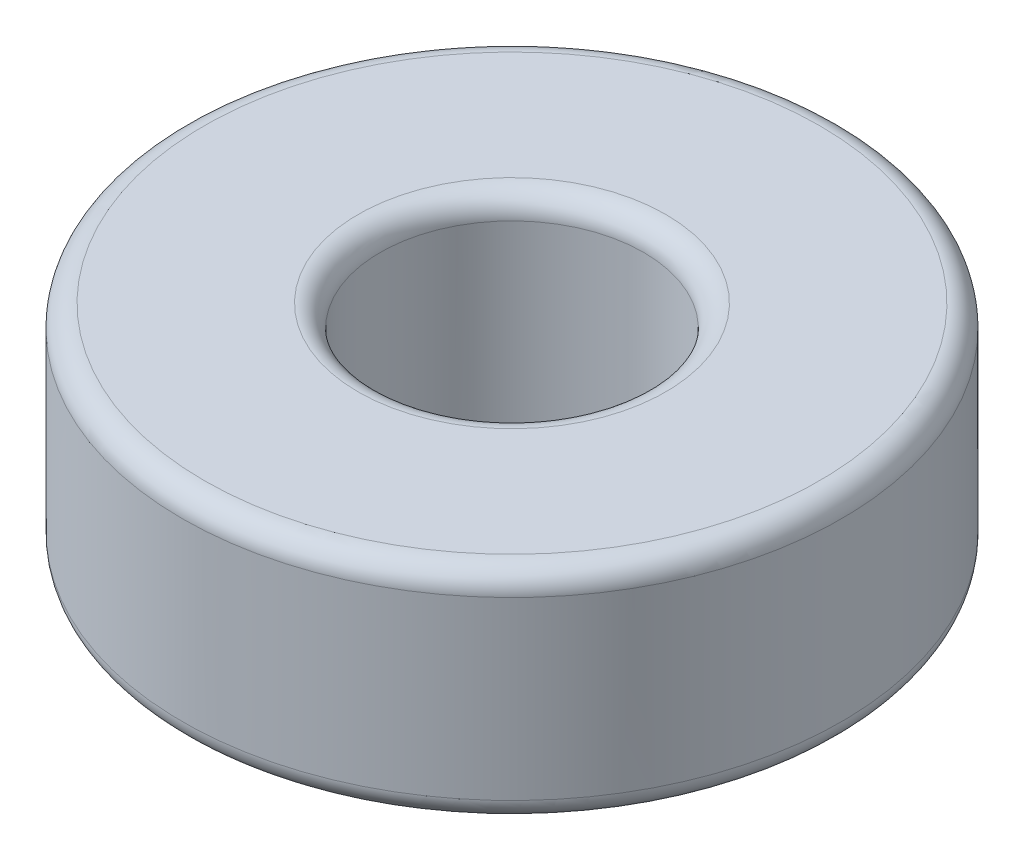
ISO-10303-21;
HEADER;
FILE_DESCRIPTION(('STEP AP214'),'2;1');
FILE_NAME('part.step','',(''),(''),'','','');
FILE_SCHEMA(('AUTOMOTIVE_DESIGN { 1 0 10303 214 1 1 1 1 }'));
ENDSEC;
DATA;
#1=APPLICATION_CONTEXT('core data for automotive mechanical design processes');
#2=APPLICATION_PROTOCOL_DEFINITION('international standard','automotive_design',2000,#1);
#3=PRODUCT_CONTEXT('',#1,'mechanical');
#4=PRODUCT('Part','Part','',(#3));
#5=PRODUCT_RELATED_PRODUCT_CATEGORY('part','',(#4));
#6=PRODUCT_DEFINITION_FORMATION('','',#4);
#7=PRODUCT_DEFINITION_CONTEXT('part definition',#1,'design');
#8=PRODUCT_DEFINITION('design','',#6,#7);
#9=PRODUCT_DEFINITION_SHAPE('','',#8);
#10=(LENGTH_UNIT() NAMED_UNIT(*) SI_UNIT(.MILLI.,.METRE.));
#11=(NAMED_UNIT(*) PLANE_ANGLE_UNIT() SI_UNIT($,.RADIAN.));
#12=(NAMED_UNIT(*) SI_UNIT($,.STERADIAN.) SOLID_ANGLE_UNIT());
#13=UNCERTAINTY_MEASURE_WITH_UNIT(LENGTH_MEASURE(1.E-05),#10,'distance_accuracy_value','');
#14=(GEOMETRIC_REPRESENTATION_CONTEXT(3) GLOBAL_UNCERTAINTY_ASSIGNED_CONTEXT((#13)) GLOBAL_UNIT_ASSIGNED_CONTEXT((#10,
#11,#12)) REPRESENTATION_CONTEXT('',''));
#15=CARTESIAN_POINT('',(0.,0.,0.));
#16=DIRECTION('',(0.,0.,1.));
#17=DIRECTION('',(1.,0.,0.));
#18=AXIS2_PLACEMENT_3D('',#15,#16,#17);
#19=CARTESIAN_POINT('',(0.,0.,0.));
#20=DIRECTION('',(0.,1.,0.));
#21=DIRECTION('',(0.,0.,1.));
#22=AXIS2_PLACEMENT_3D('',#19,#20,#21);
#23=PLANE('',#22);
#24=CARTESIAN_POINT('',(0.,0.,0.));
#25=DIRECTION('',(0.,1.,0.));
#26=DIRECTION('',(0.,0.,1.));
#27=AXIS2_PLACEMENT_3D('',#24,#25,#26);
#28=CIRCLE('',#27,7.);
#29=CARTESIAN_POINT('',(0.,0.,7.));
#30=VERTEX_POINT('',#29);
#31=CARTESIAN_POINT('',(0.,0.,-7.));
#32=VERTEX_POINT('',#31);
#33=EDGE_CURVE('E65',#30,#32,#28,.T.);
#34=ORIENTED_EDGE('',*,*,#33,.F.);
#35=CARTESIAN_POINT('',(0.,0.,0.));
#36=DIRECTION('',(0.,1.,0.));
#37=DIRECTION('',(0.,0.,-1.));
#38=AXIS2_PLACEMENT_3D('',#35,#36,#37);
#39=CIRCLE('',#38,7.);
#40=EDGE_CURVE('E94',#32,#30,#39,.T.);
#41=ORIENTED_EDGE('',*,*,#40,.F.);
#42=EDGE_LOOP('',(#34,#41));
#43=FACE_BOUND('',#42,.T.);
#44=CARTESIAN_POINT('',(0.,0.,0.));
#45=DIRECTION('',(0.,-1.,0.));
#46=DIRECTION('',(0.,0.,1.));
#47=AXIS2_PLACEMENT_3D('',#44,#45,#46);
#48=CIRCLE('',#47,3.5);
#49=CARTESIAN_POINT('',(0.,0.,3.5));
#50=VERTEX_POINT('',#49);
#51=CARTESIAN_POINT('',(0.,0.,-3.5));
#52=VERTEX_POINT('',#51);
#53=EDGE_CURVE('E54',#50,#52,#48,.T.);
#54=ORIENTED_EDGE('',*,*,#53,.F.);
#55=CARTESIAN_POINT('',(0.,0.,0.));
#56=DIRECTION('',(0.,-1.,0.));
#57=DIRECTION('',(0.,0.,-1.));
#58=AXIS2_PLACEMENT_3D('',#55,#56,#57);
#59=CIRCLE('',#58,3.5);
#60=EDGE_CURVE('E58',#52,#50,#59,.T.);
#61=ORIENTED_EDGE('',*,*,#60,.F.);
#62=EDGE_LOOP('',(#54,#61));
#63=FACE_BOUND('',#62,.T.);
#64=ADVANCED_FACE('F17',(#43,#63),#23,.F.);
#65=CARTESIAN_POINT('',(0.,0.5,0.));
#66=DIRECTION('',(0.,1.,0.));
#67=DIRECTION('',(0.,0.,1.));
#68=AXIS2_PLACEMENT_3D('',#65,#66,#67);
#69=TOROIDAL_SURFACE('',#68,3.5,0.5);
#70=ORIENTED_EDGE('',*,*,#53,.T.);
#71=ORIENTED_EDGE('',*,*,#60,.T.);
#72=EDGE_LOOP('',(#70,#71));
#73=FACE_BOUND('',#72,.T.);
#74=CARTESIAN_POINT('',(0.,0.5,0.));
#75=DIRECTION('',(0.,-1.,0.));
#76=DIRECTION('',(0.,0.,-1.));
#77=AXIS2_PLACEMENT_3D('',#74,#75,#76);
#78=CIRCLE('',#77,3.);
#79=CARTESIAN_POINT('',(0.,0.5,-3.));
#80=VERTEX_POINT('',#79);
#81=EDGE_CURVE('E90',#80,#80,#78,.F.);
#82=ORIENTED_EDGE('',*,*,#81,.T.);
#83=EDGE_LOOP('',(#82));
#84=FACE_BOUND('',#83,.T.);
#85=ADVANCED_FACE('F63',(#73,#84),#69,.T.);
#86=CARTESIAN_POINT('',(0.,0.5,0.));
#87=DIRECTION('',(0.,1.,0.));
#88=DIRECTION('',(0.,0.,1.));
#89=AXIS2_PLACEMENT_3D('',#86,#87,#88);
#90=TOROIDAL_SURFACE('',#89,7.,0.5);
#91=ORIENTED_EDGE('',*,*,#33,.T.);
#92=ORIENTED_EDGE('',*,*,#40,.T.);
#93=EDGE_LOOP('',(#91,#92));
#94=FACE_BOUND('',#93,.T.);
#95=CARTESIAN_POINT('',(0.,0.5,0.));
#96=DIRECTION('',(0.,-1.,0.));
#97=DIRECTION('',(0.,0.,-1.));
#98=AXIS2_PLACEMENT_3D('',#95,#96,#97);
#99=CIRCLE('',#98,7.5);
#100=CARTESIAN_POINT('',(0.,0.5,-7.5));
#101=VERTEX_POINT('',#100);
#102=EDGE_CURVE('E93',#101,#101,#99,.F.);
#103=ORIENTED_EDGE('',*,*,#102,.F.);
#104=EDGE_LOOP('',(#103));
#105=FACE_BOUND('',#104,.T.);
#106=ADVANCED_FACE('F83',(#94,#105),#90,.T.);
#107=CARTESIAN_POINT('',(0.,5.,0.));
#108=DIRECTION('',(0.,-1.,0.));
#109=DIRECTION('',(0.,0.,-1.));
#110=AXIS2_PLACEMENT_3D('',#107,#108,#109);
#111=CYLINDRICAL_SURFACE('',#110,3.);
#112=CARTESIAN_POINT('',(0.,4.5,0.));
#113=DIRECTION('',(0.,1.,0.));
#114=DIRECTION('',(0.,0.,1.));
#115=AXIS2_PLACEMENT_3D('',#112,#113,#114);
#116=CIRCLE('',#115,3.);
#117=CARTESIAN_POINT('',(0.,4.5,3.));
#118=VERTEX_POINT('',#117);
#119=EDGE_CURVE('E96',#118,#118,#116,.F.);
#120=ORIENTED_EDGE('',*,*,#119,.F.);
#121=EDGE_LOOP('',(#120));
#122=FACE_BOUND('',#121,.T.);
#123=ORIENTED_EDGE('',*,*,#81,.F.);
#124=EDGE_LOOP('',(#123));
#125=FACE_BOUND('',#124,.T.);
#126=ADVANCED_FACE('F249',(#122,#125),#111,.F.);
#127=CARTESIAN_POINT('',(0.,5.,0.));
#128=DIRECTION('',(0.,-1.,0.));
#129=DIRECTION('',(0.,0.,-1.));
#130=AXIS2_PLACEMENT_3D('',#127,#128,#129);
#131=CYLINDRICAL_SURFACE('',#130,7.5);
#132=CARTESIAN_POINT('',(0.,4.5,0.));
#133=DIRECTION('',(0.,1.,0.));
#134=DIRECTION('',(0.,0.,1.));
#135=AXIS2_PLACEMENT_3D('',#132,#133,#134);
#136=CIRCLE('',#135,7.5);
#137=CARTESIAN_POINT('',(0.,4.5,7.5));
#138=VERTEX_POINT('',#137);
#139=EDGE_CURVE('E101',#138,#138,#136,.T.);
#140=ORIENTED_EDGE('',*,*,#139,.F.);
#141=EDGE_LOOP('',(#140));
#142=FACE_BOUND('',#141,.T.);
#143=ORIENTED_EDGE('',*,*,#102,.T.);
#144=EDGE_LOOP('',(#143));
#145=FACE_BOUND('',#144,.T.);
#146=ADVANCED_FACE('F121',(#142,#145),#131,.T.);
#147=CARTESIAN_POINT('',(0.,4.5,0.));
#148=DIRECTION('',(0.,1.,0.));
#149=DIRECTION('',(0.,0.,1.));
#150=AXIS2_PLACEMENT_3D('',#147,#148,#149);
#151=TOROIDAL_SURFACE('',#150,3.5,0.5);
#152=ORIENTED_EDGE('',*,*,#119,.T.);
#153=EDGE_LOOP('',(#152));
#154=FACE_BOUND('',#153,.T.);
#155=CARTESIAN_POINT('',(0.,5.,0.));
#156=DIRECTION('',(0.,1.,0.));
#157=DIRECTION('',(0.,0.,1.));
#158=AXIS2_PLACEMENT_3D('',#155,#156,#157);
#159=CIRCLE('',#158,3.5);
#160=CARTESIAN_POINT('',(0.,5.,-3.5));
#161=VERTEX_POINT('',#160);
#162=CARTESIAN_POINT('',(0.,5.,3.5));
#163=VERTEX_POINT('',#162);
#164=EDGE_CURVE('E171',#161,#163,#159,.F.);
#165=ORIENTED_EDGE('',*,*,#164,.F.);
#166=CARTESIAN_POINT('',(0.,5.,0.));
#167=DIRECTION('',(0.,1.,0.));
#168=DIRECTION('',(0.,0.,-1.));
#169=AXIS2_PLACEMENT_3D('',#166,#167,#168);
#170=CIRCLE('',#169,3.5);
#171=EDGE_CURVE('E104',#163,#161,#170,.F.);
#172=ORIENTED_EDGE('',*,*,#171,.F.);
#173=EDGE_LOOP('',(#165,#172));
#174=FACE_BOUND('',#173,.T.);
#175=ADVANCED_FACE('F110',(#154,#174),#151,.T.);
#176=CARTESIAN_POINT('',(0.,4.5,0.));
#177=DIRECTION('',(0.,1.,0.));
#178=DIRECTION('',(0.,0.,1.));
#179=AXIS2_PLACEMENT_3D('',#176,#177,#178);
#180=TOROIDAL_SURFACE('',#179,7.,0.5);
#181=ORIENTED_EDGE('',*,*,#139,.T.);
#182=EDGE_LOOP('',(#181));
#183=FACE_BOUND('',#182,.T.);
#184=CARTESIAN_POINT('',(0.,5.,0.));
#185=DIRECTION('',(0.,-1.,0.));
#186=DIRECTION('',(0.,0.,1.));
#187=AXIS2_PLACEMENT_3D('',#184,#185,#186);
#188=CIRCLE('',#187,7.);
#189=CARTESIAN_POINT('',(0.,5.,-7.));
#190=VERTEX_POINT('',#189);
#191=CARTESIAN_POINT('',(0.,5.,7.));
#192=VERTEX_POINT('',#191);
#193=EDGE_CURVE('E11',#190,#192,#188,.F.);
#194=ORIENTED_EDGE('',*,*,#193,.F.);
#195=CARTESIAN_POINT('',(0.,5.,0.));
#196=DIRECTION('',(0.,-1.,0.));
#197=DIRECTION('',(0.,0.,-1.));
#198=AXIS2_PLACEMENT_3D('',#195,#196,#197);
#199=CIRCLE('',#198,7.);
#200=EDGE_CURVE('E28',#192,#190,#199,.F.);
#201=ORIENTED_EDGE('',*,*,#200,.F.);
#202=EDGE_LOOP('',(#194,#201));
#203=FACE_BOUND('',#202,.T.);
#204=ADVANCED_FACE('F120',(#183,#203),#180,.T.);
#205=CARTESIAN_POINT('',(0.,5.,0.));
#206=DIRECTION('',(0.,1.,0.));
#207=DIRECTION('',(0.,0.,1.));
#208=AXIS2_PLACEMENT_3D('',#205,#206,#207);
#209=PLANE('',#208);
#210=ORIENTED_EDGE('',*,*,#200,.T.);
#211=ORIENTED_EDGE('',*,*,#193,.T.);
#212=EDGE_LOOP('',(#210,#211));
#213=FACE_BOUND('',#212,.T.);
#214=ORIENTED_EDGE('',*,*,#171,.T.);
#215=ORIENTED_EDGE('',*,*,#164,.T.);
#216=EDGE_LOOP('',(#214,#215));
#217=FACE_BOUND('',#216,.T.);
#218=ADVANCED_FACE('F142',(#213,#217),#209,.T.);
#219=CLOSED_SHELL('',(#64,#85,#106,#126,#146,#175,#204,#218));
#220=MANIFOLD_SOLID_BREP('B1',#219);
#221=ADVANCED_BREP_SHAPE_REPRESENTATION('',(#18,#220),#14);
#222=SHAPE_DEFINITION_REPRESENTATION(#9,#221);
ENDSEC;
END-ISO-10303-21;
